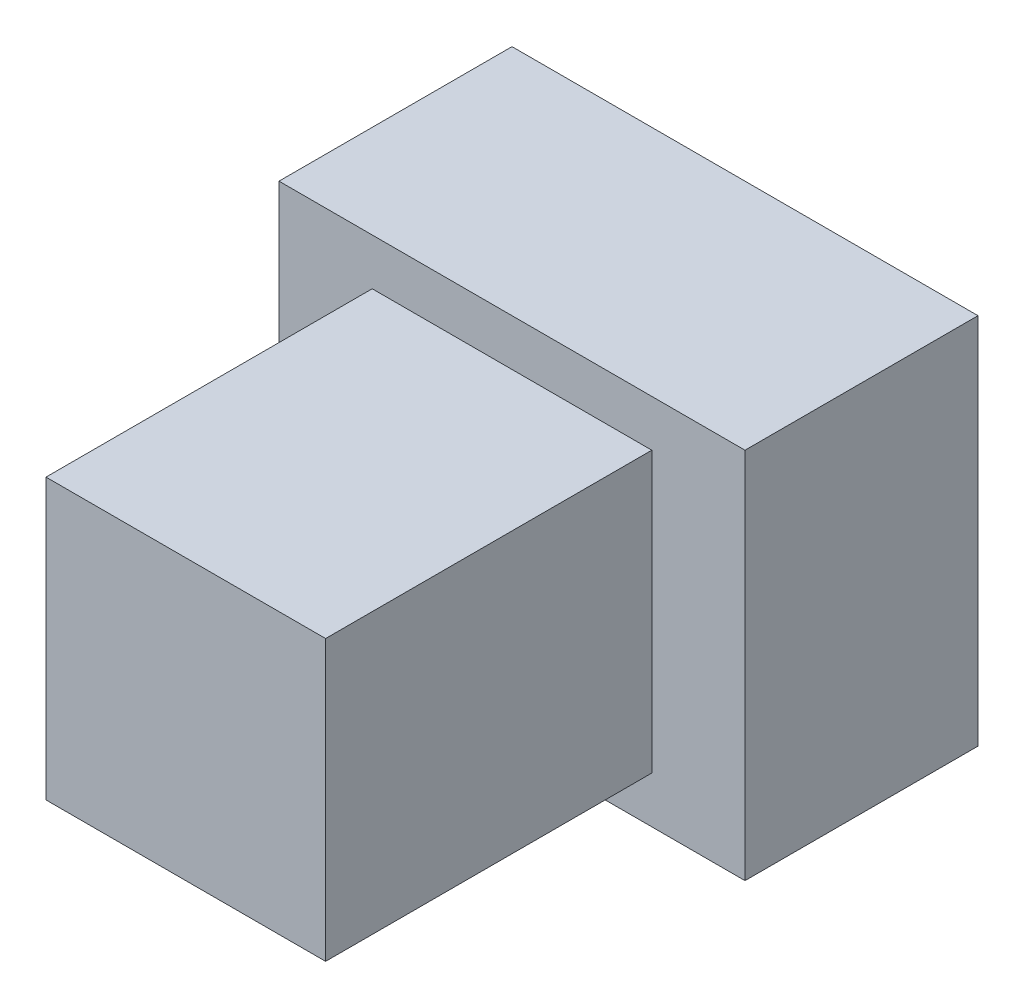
ISO-10303-21;
HEADER;
FILE_DESCRIPTION(('STEP AP214'),'2;1');
FILE_NAME('part.step','',(''),(''),'','','');
FILE_SCHEMA(('AUTOMOTIVE_DESIGN { 1 0 10303 214 1 1 1 1 }'));
ENDSEC;
DATA;
#1=APPLICATION_CONTEXT('core data for automotive mechanical design processes');
#2=APPLICATION_PROTOCOL_DEFINITION('international standard','automotive_design',2000,#1);
#3=PRODUCT_CONTEXT('',#1,'mechanical');
#4=PRODUCT('Part','Part','',(#3));
#5=PRODUCT_RELATED_PRODUCT_CATEGORY('part','',(#4));
#6=PRODUCT_DEFINITION_FORMATION('','',#4);
#7=PRODUCT_DEFINITION_CONTEXT('part definition',#1,'design');
#8=PRODUCT_DEFINITION('design','',#6,#7);
#9=PRODUCT_DEFINITION_SHAPE('','',#8);
#10=(LENGTH_UNIT() NAMED_UNIT(*) SI_UNIT(.MILLI.,.METRE.));
#11=(NAMED_UNIT(*) PLANE_ANGLE_UNIT() SI_UNIT($,.RADIAN.));
#12=(NAMED_UNIT(*) SI_UNIT($,.STERADIAN.) SOLID_ANGLE_UNIT());
#13=UNCERTAINTY_MEASURE_WITH_UNIT(LENGTH_MEASURE(1.E-05),#10,'distance_accuracy_value','');
#14=(GEOMETRIC_REPRESENTATION_CONTEXT(3) GLOBAL_UNCERTAINTY_ASSIGNED_CONTEXT((#13)) GLOBAL_UNIT_ASSIGNED_CONTEXT((#10,
#11,#12)) REPRESENTATION_CONTEXT('',''));
#15=CARTESIAN_POINT('',(0.,0.,0.));
#16=DIRECTION('',(0.,0.,1.));
#17=DIRECTION('',(1.,0.,0.));
#18=AXIS2_PLACEMENT_3D('',#15,#16,#17);
#19=CARTESIAN_POINT('',(-50.,-40.,50.));
#20=DIRECTION('',(0.,0.,1.));
#21=DIRECTION('',(1.,0.,0.));
#22=AXIS2_PLACEMENT_3D('',#19,#20,#21);
#23=PLANE('',#22);
#24=DIRECTION('',(0.,-1.,0.));
#25=VECTOR('',#24,1.);
#26=CARTESIAN_POINT('',(-50.,40.,50.));
#27=LINE('',#26,#25);
#28=CARTESIAN_POINT('',(-50.,40.,50.));
#29=VERTEX_POINT('',#28);
#30=CARTESIAN_POINT('',(-50.,-40.,50.));
#31=VERTEX_POINT('',#30);
#32=EDGE_CURVE('E138',#29,#31,#27,.T.);
#33=ORIENTED_EDGE('',*,*,#32,.T.);
#34=DIRECTION('',(1.,0.,0.));
#35=VECTOR('',#34,1.);
#36=CARTESIAN_POINT('',(-50.,-40.,50.));
#37=LINE('',#36,#35);
#38=CARTESIAN_POINT('',(50.,-40.,50.));
#39=VERTEX_POINT('',#38);
#40=EDGE_CURVE('E83',#31,#39,#37,.T.);
#41=ORIENTED_EDGE('',*,*,#40,.T.);
#42=DIRECTION('',(0.,1.,0.));
#43=VECTOR('',#42,1.);
#44=CARTESIAN_POINT('',(50.,40.,50.));
#45=LINE('',#44,#43);
#46=CARTESIAN_POINT('',(50.,40.,50.));
#47=VERTEX_POINT('',#46);
#48=EDGE_CURVE('E141',#39,#47,#45,.T.);
#49=ORIENTED_EDGE('',*,*,#48,.T.);
#50=DIRECTION('',(-1.,0.,0.));
#51=VECTOR('',#50,1.);
#52=CARTESIAN_POINT('',(-50.,40.,50.));
#53=LINE('',#52,#51);
#54=EDGE_CURVE('E55',#47,#29,#53,.T.);
#55=ORIENTED_EDGE('',*,*,#54,.T.);
#56=EDGE_LOOP('',(#33,#41,#49,#55));
#57=FACE_BOUND('',#56,.T.);
#58=DIRECTION('',(1.,0.,0.));
#59=VECTOR('',#58,1.);
#60=CARTESIAN_POINT('',(-30.,-30.,50.));
#61=LINE('',#60,#59);
#62=CARTESIAN_POINT('',(-30.,-30.,50.));
#63=VERTEX_POINT('',#62);
#64=CARTESIAN_POINT('',(30.,-30.,50.));
#65=VERTEX_POINT('',#64);
#66=EDGE_CURVE('E261',#63,#65,#61,.T.);
#67=ORIENTED_EDGE('',*,*,#66,.F.);
#68=DIRECTION('',(0.,-1.,0.));
#69=VECTOR('',#68,1.);
#70=CARTESIAN_POINT('',(-30.,30.,50.));
#71=LINE('',#70,#69);
#72=CARTESIAN_POINT('',(-30.,30.,50.));
#73=VERTEX_POINT('',#72);
#74=EDGE_CURVE('E128',#73,#63,#71,.T.);
#75=ORIENTED_EDGE('',*,*,#74,.F.);
#76=DIRECTION('',(-1.,0.,0.));
#77=VECTOR('',#76,1.);
#78=CARTESIAN_POINT('',(-30.,30.,50.));
#79=LINE('',#78,#77);
#80=CARTESIAN_POINT('',(30.,30.,50.));
#81=VERTEX_POINT('',#80);
#82=EDGE_CURVE('E124',#81,#73,#79,.T.);
#83=ORIENTED_EDGE('',*,*,#82,.F.);
#84=DIRECTION('',(0.,1.,0.));
#85=VECTOR('',#84,1.);
#86=CARTESIAN_POINT('',(30.,30.,50.));
#87=LINE('',#86,#85);
#88=EDGE_CURVE('E258',#65,#81,#87,.T.);
#89=ORIENTED_EDGE('',*,*,#88,.F.);
#90=EDGE_LOOP('',(#67,#75,#83,#89));
#91=FACE_BOUND('',#90,.T.);
#92=ADVANCED_FACE('F31',(#57,#91),#23,.T.);
#93=CARTESIAN_POINT('',(-50.,40.,50.));
#94=DIRECTION('',(1.,0.,0.));
#95=DIRECTION('',(0.,1.,0.));
#96=AXIS2_PLACEMENT_3D('',#93,#94,#95);
#97=PLANE('',#96);
#98=DIRECTION('',(0.,-1.,0.));
#99=VECTOR('',#98,1.);
#100=CARTESIAN_POINT('',(-50.,40.,0.));
#101=LINE('',#100,#99);
#102=CARTESIAN_POINT('',(-50.,40.,0.));
#103=VERTEX_POINT('',#102);
#104=CARTESIAN_POINT('',(-50.,-40.,0.));
#105=VERTEX_POINT('',#104);
#106=EDGE_CURVE('E130',#103,#105,#101,.T.);
#107=ORIENTED_EDGE('',*,*,#106,.T.);
#108=DIRECTION('',(0.,0.,-1.));
#109=VECTOR('',#108,1.);
#110=CARTESIAN_POINT('',(-50.,-40.,50.));
#111=LINE('',#110,#109);
#112=EDGE_CURVE('E11',#31,#105,#111,.T.);
#113=ORIENTED_EDGE('',*,*,#112,.F.);
#114=ORIENTED_EDGE('',*,*,#32,.F.);
#115=DIRECTION('',(0.,0.,-1.));
#116=VECTOR('',#115,1.);
#117=CARTESIAN_POINT('',(-50.,40.,50.));
#118=LINE('',#117,#116);
#119=EDGE_CURVE('E143',#29,#103,#118,.T.);
#120=ORIENTED_EDGE('',*,*,#119,.T.);
#121=EDGE_LOOP('',(#107,#113,#114,#120));
#122=FACE_BOUND('',#121,.T.);
#123=ADVANCED_FACE('F33',(#122),#97,.F.);
#124=CARTESIAN_POINT('',(-50.,-40.,50.));
#125=DIRECTION('',(0.,1.,0.));
#126=DIRECTION('',(-1.,0.,0.));
#127=AXIS2_PLACEMENT_3D('',#124,#125,#126);
#128=PLANE('',#127);
#129=DIRECTION('',(1.,0.,0.));
#130=VECTOR('',#129,1.);
#131=CARTESIAN_POINT('',(-50.,-40.,0.));
#132=LINE('',#131,#130);
#133=CARTESIAN_POINT('',(50.,-40.,0.));
#134=VERTEX_POINT('',#133);
#135=EDGE_CURVE('E133',#105,#134,#132,.T.);
#136=ORIENTED_EDGE('',*,*,#135,.T.);
#137=DIRECTION('',(0.,0.,-1.));
#138=VECTOR('',#137,1.);
#139=CARTESIAN_POINT('',(50.,-40.,50.));
#140=LINE('',#139,#138);
#141=EDGE_CURVE('E39',#39,#134,#140,.T.);
#142=ORIENTED_EDGE('',*,*,#141,.F.);
#143=ORIENTED_EDGE('',*,*,#40,.F.);
#144=ORIENTED_EDGE('',*,*,#112,.T.);
#145=EDGE_LOOP('',(#136,#142,#143,#144));
#146=FACE_BOUND('',#145,.T.);
#147=ADVANCED_FACE('F171',(#146),#128,.F.);
#148=CARTESIAN_POINT('',(50.,40.,50.));
#149=DIRECTION('',(-1.,0.,0.));
#150=DIRECTION('',(0.,-1.,0.));
#151=AXIS2_PLACEMENT_3D('',#148,#149,#150);
#152=PLANE('',#151);
#153=DIRECTION('',(0.,1.,0.));
#154=VECTOR('',#153,1.);
#155=CARTESIAN_POINT('',(50.,40.,0.));
#156=LINE('',#155,#154);
#157=CARTESIAN_POINT('',(50.,40.,0.));
#158=VERTEX_POINT('',#157);
#159=EDGE_CURVE('E146',#134,#158,#156,.T.);
#160=ORIENTED_EDGE('',*,*,#159,.T.);
#161=DIRECTION('',(0.,0.,-1.));
#162=VECTOR('',#161,1.);
#163=CARTESIAN_POINT('',(50.,40.,50.));
#164=LINE('',#163,#162);
#165=EDGE_CURVE('E150',#47,#158,#164,.T.);
#166=ORIENTED_EDGE('',*,*,#165,.F.);
#167=ORIENTED_EDGE('',*,*,#48,.F.);
#168=ORIENTED_EDGE('',*,*,#141,.T.);
#169=EDGE_LOOP('',(#160,#166,#167,#168));
#170=FACE_BOUND('',#169,.T.);
#171=ADVANCED_FACE('F155',(#170),#152,.F.);
#172=CARTESIAN_POINT('',(-50.,40.,50.));
#173=DIRECTION('',(0.,-1.,0.));
#174=DIRECTION('',(0.,0.,-1.));
#175=AXIS2_PLACEMENT_3D('',#172,#173,#174);
#176=PLANE('',#175);
#177=DIRECTION('',(-1.,0.,0.));
#178=VECTOR('',#177,1.);
#179=CARTESIAN_POINT('',(-50.,40.,0.));
#180=LINE('',#179,#178);
#181=EDGE_CURVE('E76',#158,#103,#180,.T.);
#182=ORIENTED_EDGE('',*,*,#181,.T.);
#183=ORIENTED_EDGE('',*,*,#119,.F.);
#184=ORIENTED_EDGE('',*,*,#54,.F.);
#185=ORIENTED_EDGE('',*,*,#165,.T.);
#186=EDGE_LOOP('',(#182,#183,#184,#185));
#187=FACE_BOUND('',#186,.T.);
#188=ADVANCED_FACE('F163',(#187),#176,.F.);
#189=CARTESIAN_POINT('',(-50.,-40.,0.));
#190=DIRECTION('',(0.,0.,1.));
#191=DIRECTION('',(1.,0.,0.));
#192=AXIS2_PLACEMENT_3D('',#189,#190,#191);
#193=PLANE('',#192);
#194=ORIENTED_EDGE('',*,*,#106,.F.);
#195=ORIENTED_EDGE('',*,*,#181,.F.);
#196=ORIENTED_EDGE('',*,*,#159,.F.);
#197=ORIENTED_EDGE('',*,*,#135,.F.);
#198=EDGE_LOOP('',(#194,#195,#196,#197));
#199=FACE_BOUND('',#198,.T.);
#200=ADVANCED_FACE('F159',(#199),#193,.F.);
#201=CARTESIAN_POINT('',(-30.,30.,120.));
#202=DIRECTION('',(1.,0.,0.));
#203=DIRECTION('',(0.,1.,0.));
#204=AXIS2_PLACEMENT_3D('',#201,#202,#203);
#205=PLANE('',#204);
#206=ORIENTED_EDGE('',*,*,#74,.T.);
#207=DIRECTION('',(0.,0.,-1.));
#208=VECTOR('',#207,1.);
#209=CARTESIAN_POINT('',(-30.,-30.,120.));
#210=LINE('',#209,#208);
#211=CARTESIAN_POINT('',(-30.,-30.,120.));
#212=VERTEX_POINT('',#211);
#213=EDGE_CURVE('E109',#212,#63,#210,.T.);
#214=ORIENTED_EDGE('',*,*,#213,.F.);
#215=DIRECTION('',(0.,-1.,0.));
#216=VECTOR('',#215,1.);
#217=CARTESIAN_POINT('',(-30.,30.,120.));
#218=LINE('',#217,#216);
#219=CARTESIAN_POINT('',(-30.,30.,120.));
#220=VERTEX_POINT('',#219);
#221=EDGE_CURVE('E116',#220,#212,#218,.T.);
#222=ORIENTED_EDGE('',*,*,#221,.F.);
#223=DIRECTION('',(0.,0.,-1.));
#224=VECTOR('',#223,1.);
#225=CARTESIAN_POINT('',(-30.,30.,120.));
#226=LINE('',#225,#224);
#227=EDGE_CURVE('E256',#220,#73,#226,.T.);
#228=ORIENTED_EDGE('',*,*,#227,.T.);
#229=EDGE_LOOP('',(#206,#214,#222,#228));
#230=FACE_BOUND('',#229,.T.);
#231=ADVANCED_FACE('F126',(#230),#205,.F.);
#232=CARTESIAN_POINT('',(-30.,-30.,120.));
#233=DIRECTION('',(0.,1.,0.));
#234=DIRECTION('',(0.,0.,1.));
#235=AXIS2_PLACEMENT_3D('',#232,#233,#234);
#236=PLANE('',#235);
#237=ORIENTED_EDGE('',*,*,#66,.T.);
#238=DIRECTION('',(0.,0.,-1.));
#239=VECTOR('',#238,1.);
#240=CARTESIAN_POINT('',(30.,-30.,120.));
#241=LINE('',#240,#239);
#242=CARTESIAN_POINT('',(30.,-30.,120.));
#243=VERTEX_POINT('',#242);
#244=EDGE_CURVE('E112',#243,#65,#241,.T.);
#245=ORIENTED_EDGE('',*,*,#244,.F.);
#246=DIRECTION('',(1.,0.,0.));
#247=VECTOR('',#246,1.);
#248=CARTESIAN_POINT('',(-30.,-30.,120.));
#249=LINE('',#248,#247);
#250=EDGE_CURVE('E105',#212,#243,#249,.T.);
#251=ORIENTED_EDGE('',*,*,#250,.F.);
#252=ORIENTED_EDGE('',*,*,#213,.T.);
#253=EDGE_LOOP('',(#237,#245,#251,#252));
#254=FACE_BOUND('',#253,.T.);
#255=ADVANCED_FACE('F107',(#254),#236,.F.);
#256=CARTESIAN_POINT('',(30.,30.,120.));
#257=DIRECTION('',(-1.,0.,0.));
#258=DIRECTION('',(0.,-1.,0.));
#259=AXIS2_PLACEMENT_3D('',#256,#257,#258);
#260=PLANE('',#259);
#261=ORIENTED_EDGE('',*,*,#88,.T.);
#262=DIRECTION('',(0.,0.,-1.));
#263=VECTOR('',#262,1.);
#264=CARTESIAN_POINT('',(30.,30.,120.));
#265=LINE('',#264,#263);
#266=CARTESIAN_POINT('',(30.,30.,120.));
#267=VERTEX_POINT('',#266);
#268=EDGE_CURVE('E46',#267,#81,#265,.T.);
#269=ORIENTED_EDGE('',*,*,#268,.F.);
#270=DIRECTION('',(0.,1.,0.));
#271=VECTOR('',#270,1.);
#272=CARTESIAN_POINT('',(30.,30.,120.));
#273=LINE('',#272,#271);
#274=EDGE_CURVE('E115',#243,#267,#273,.T.);
#275=ORIENTED_EDGE('',*,*,#274,.F.);
#276=ORIENTED_EDGE('',*,*,#244,.T.);
#277=EDGE_LOOP('',(#261,#269,#275,#276));
#278=FACE_BOUND('',#277,.T.);
#279=ADVANCED_FACE('F184',(#278),#260,.F.);
#280=CARTESIAN_POINT('',(-30.,30.,120.));
#281=DIRECTION('',(0.,-1.,0.));
#282=DIRECTION('',(0.,0.,-1.));
#283=AXIS2_PLACEMENT_3D('',#280,#281,#282);
#284=PLANE('',#283);
#285=ORIENTED_EDGE('',*,*,#82,.T.);
#286=ORIENTED_EDGE('',*,*,#227,.F.);
#287=DIRECTION('',(-1.,0.,0.));
#288=VECTOR('',#287,1.);
#289=CARTESIAN_POINT('',(-30.,30.,120.));
#290=LINE('',#289,#288);
#291=EDGE_CURVE('E120',#267,#220,#290,.T.);
#292=ORIENTED_EDGE('',*,*,#291,.F.);
#293=ORIENTED_EDGE('',*,*,#268,.T.);
#294=EDGE_LOOP('',(#285,#286,#292,#293));
#295=FACE_BOUND('',#294,.T.);
#296=ADVANCED_FACE('F187',(#295),#284,.F.);
#297=CARTESIAN_POINT('',(-30.,-30.,120.));
#298=DIRECTION('',(0.,0.,1.));
#299=DIRECTION('',(1.,0.,0.));
#300=AXIS2_PLACEMENT_3D('',#297,#298,#299);
#301=PLANE('',#300);
#302=ORIENTED_EDGE('',*,*,#221,.T.);
#303=ORIENTED_EDGE('',*,*,#250,.T.);
#304=ORIENTED_EDGE('',*,*,#274,.T.);
#305=ORIENTED_EDGE('',*,*,#291,.T.);
#306=EDGE_LOOP('',(#302,#303,#304,#305));
#307=FACE_BOUND('',#306,.T.);
#308=ADVANCED_FACE('F119',(#307),#301,.T.);
#309=CLOSED_SHELL('',(#92,#123,#147,#171,#188,#200,#231,#255,#279,#296,#308));
#310=MANIFOLD_SOLID_BREP('B2',#309);
#311=ADVANCED_BREP_SHAPE_REPRESENTATION('',(#18,#310),#14);
#312=SHAPE_DEFINITION_REPRESENTATION(#9,#311);
ENDSEC;
END-ISO-10303-21;
